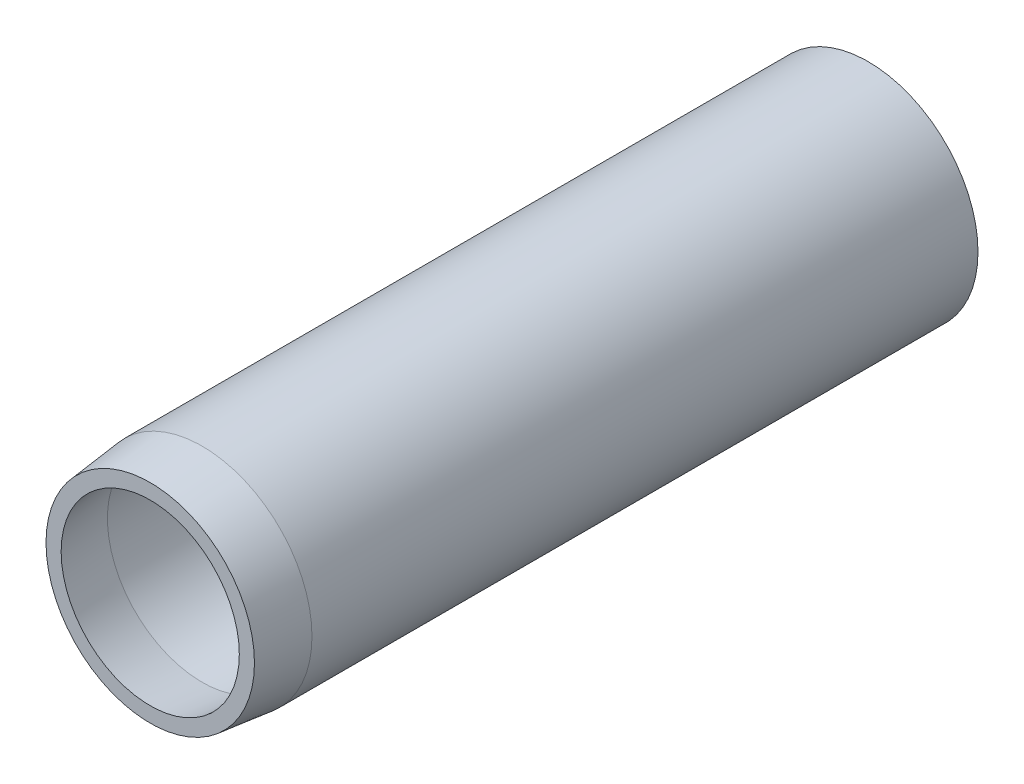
ISO-10303-21;
HEADER;
FILE_DESCRIPTION(('STEP AP214'),'2;1');
FILE_NAME('part.step','',(''),(''),'','','');
FILE_SCHEMA(('AUTOMOTIVE_DESIGN { 1 0 10303 214 1 1 1 1 }'));
ENDSEC;
DATA;
#1=APPLICATION_CONTEXT('core data for automotive mechanical design processes');
#2=APPLICATION_PROTOCOL_DEFINITION('international standard','automotive_design',2000,#1);
#3=PRODUCT_CONTEXT('',#1,'mechanical');
#4=PRODUCT('Part','Part','',(#3));
#5=PRODUCT_RELATED_PRODUCT_CATEGORY('part','',(#4));
#6=PRODUCT_DEFINITION_FORMATION('','',#4);
#7=PRODUCT_DEFINITION_CONTEXT('part definition',#1,'design');
#8=PRODUCT_DEFINITION('design','',#6,#7);
#9=PRODUCT_DEFINITION_SHAPE('','',#8);
#10=(LENGTH_UNIT() NAMED_UNIT(*) SI_UNIT(.MILLI.,.METRE.));
#11=(NAMED_UNIT(*) PLANE_ANGLE_UNIT() SI_UNIT($,.RADIAN.));
#12=(NAMED_UNIT(*) SI_UNIT($,.STERADIAN.) SOLID_ANGLE_UNIT());
#13=UNCERTAINTY_MEASURE_WITH_UNIT(LENGTH_MEASURE(1.E-05),#10,'distance_accuracy_value','');
#14=(GEOMETRIC_REPRESENTATION_CONTEXT(3) GLOBAL_UNCERTAINTY_ASSIGNED_CONTEXT((#13)) GLOBAL_UNIT_ASSIGNED_CONTEXT((#10,
#11,#12)) REPRESENTATION_CONTEXT('',''));
#15=CARTESIAN_POINT('',(0.,0.,0.));
#16=DIRECTION('',(0.,0.,1.));
#17=DIRECTION('',(1.,0.,0.));
#18=AXIS2_PLACEMENT_3D('',#15,#16,#17);
#19=CARTESIAN_POINT('',(0.,1.3081,0.));
#20=DIRECTION('',(0.,0.,-1.));
#21=DIRECTION('',(-1.,0.,0.));
#22=AXIS2_PLACEMENT_3D('',#19,#20,#21);
#23=PLANE('',#22);
#24=CARTESIAN_POINT('',(0.,0.,0.));
#25=DIRECTION('',(0.,0.,1.));
#26=DIRECTION('',(1.,0.,0.));
#27=AXIS2_PLACEMENT_3D('',#24,#25,#26);
#28=CIRCLE('',#27,1.3081);
#29=CARTESIAN_POINT('',(1.3081,0.,0.));
#30=VERTEX_POINT('',#29);
#31=EDGE_CURVE('E59',#30,#30,#28,.T.);
#32=ORIENTED_EDGE('',*,*,#31,.F.);
#33=EDGE_LOOP('',(#32));
#34=FACE_BOUND('',#33,.T.);
#35=CARTESIAN_POINT('',(0.,0.,0.));
#36=DIRECTION('',(0.,0.,1.));
#37=DIRECTION('',(1.,0.,0.));
#38=AXIS2_PLACEMENT_3D('',#35,#36,#37);
#39=CIRCLE('',#38,1.53035);
#40=CARTESIAN_POINT('',(1.53035,0.,0.));
#41=VERTEX_POINT('',#40);
#42=EDGE_CURVE('E10',#41,#41,#39,.T.);
#43=ORIENTED_EDGE('',*,*,#42,.T.);
#44=EDGE_LOOP('',(#43));
#45=FACE_BOUND('',#44,.T.);
#46=ADVANCED_FACE('F28',(#34,#45),#23,.F.);
#47=CARTESIAN_POINT('',(0.,0.,-0.761999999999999));
#48=DIRECTION('',(0.,0.,-1.));
#49=DIRECTION('',(-1.,0.,0.));
#50=AXIS2_PLACEMENT_3D('',#47,#48,#49);
#51=CONICAL_SURFACE('',#50,1.6129,0.107912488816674);
#52=ORIENTED_EDGE('',*,*,#42,.F.);
#53=EDGE_LOOP('',(#52));
#54=FACE_BOUND('',#53,.T.);
#55=CARTESIAN_POINT('',(0.,0.,-0.761999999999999));
#56=DIRECTION('',(0.,0.,1.));
#57=DIRECTION('',(1.,0.,0.));
#58=AXIS2_PLACEMENT_3D('',#55,#56,#57);
#59=CIRCLE('',#58,1.6129);
#60=CARTESIAN_POINT('',(1.6129,0.,-0.761999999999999));
#61=VERTEX_POINT('',#60);
#62=EDGE_CURVE('E34',#61,#61,#59,.T.);
#63=ORIENTED_EDGE('',*,*,#62,.T.);
#64=EDGE_LOOP('',(#63));
#65=FACE_BOUND('',#64,.T.);
#66=ADVANCED_FACE('F66',(#54,#65),#51,.T.);
#67=CARTESIAN_POINT('',(0.,0.,15.7601929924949));
#68=DIRECTION('',(0.,0.,1.));
#69=DIRECTION('',(1.,0.,0.));
#70=AXIS2_PLACEMENT_3D('',#67,#68,#69);
#71=CYLINDRICAL_SURFACE('',#70,1.6129);
#72=ORIENTED_EDGE('',*,*,#62,.F.);
#73=EDGE_LOOP('',(#72));
#74=FACE_BOUND('',#73,.T.);
#75=CARTESIAN_POINT('',(0.,0.,-10.541));
#76=DIRECTION('',(0.,0.,1.));
#77=DIRECTION('',(1.,0.,0.));
#78=AXIS2_PLACEMENT_3D('',#75,#76,#77);
#79=CIRCLE('',#78,1.6129);
#80=CARTESIAN_POINT('',(1.6129,0.,-10.541));
#81=VERTEX_POINT('',#80);
#82=EDGE_CURVE('E38',#81,#81,#79,.T.);
#83=ORIENTED_EDGE('',*,*,#82,.T.);
#84=EDGE_LOOP('',(#83));
#85=FACE_BOUND('',#84,.T.);
#86=ADVANCED_FACE('F70',(#74,#85),#71,.T.);
#87=CARTESIAN_POINT('',(0.,1.6129,-10.541));
#88=DIRECTION('',(0.,0.,1.));
#89=DIRECTION('',(1.,0.,0.));
#90=AXIS2_PLACEMENT_3D('',#87,#88,#89);
#91=PLANE('',#90);
#92=ORIENTED_EDGE('',*,*,#82,.F.);
#93=EDGE_LOOP('',(#92));
#94=FACE_BOUND('',#93,.T.);
#95=CARTESIAN_POINT('',(0.,0.,-10.541));
#96=DIRECTION('',(0.,0.,1.));
#97=DIRECTION('',(1.,0.,0.));
#98=AXIS2_PLACEMENT_3D('',#95,#96,#97);
#99=CIRCLE('',#98,1.143);
#100=CARTESIAN_POINT('',(1.143,0.,-10.541));
#101=VERTEX_POINT('',#100);
#102=EDGE_CURVE('E42',#101,#101,#99,.T.);
#103=ORIENTED_EDGE('',*,*,#102,.T.);
#104=EDGE_LOOP('',(#103));
#105=FACE_BOUND('',#104,.T.);
#106=ADVANCED_FACE('F75',(#94,#105),#91,.F.);
#107=CARTESIAN_POINT('',(0.,0.,-10.0296612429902));
#108=DIRECTION('',(0.,0.,-1.));
#109=DIRECTION('',(-1.,0.,0.));
#110=AXIS2_PLACEMENT_3D('',#107,#108,#109);
#111=CONICAL_SURFACE('',#110,0.6985,0.715584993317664);
#112=ORIENTED_EDGE('',*,*,#102,.F.);
#113=EDGE_LOOP('',(#112));
#114=FACE_BOUND('',#113,.T.);
#115=CARTESIAN_POINT('',(0.,0.,-10.0296612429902));
#116=DIRECTION('',(0.,0.,1.));
#117=DIRECTION('',(1.,0.,0.));
#118=AXIS2_PLACEMENT_3D('',#115,#116,#117);
#119=CIRCLE('',#118,0.6985);
#120=CARTESIAN_POINT('',(0.6985,0.,-10.0296612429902));
#121=VERTEX_POINT('',#120);
#122=EDGE_CURVE('E47',#121,#121,#119,.T.);
#123=ORIENTED_EDGE('',*,*,#122,.T.);
#124=EDGE_LOOP('',(#123));
#125=FACE_BOUND('',#124,.T.);
#126=ADVANCED_FACE('F81',(#114,#125),#111,.F.);
#127=CARTESIAN_POINT('',(0.,0.,15.7601929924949));
#128=DIRECTION('',(0.,0.,1.));
#129=DIRECTION('',(1.,0.,0.));
#130=AXIS2_PLACEMENT_3D('',#127,#128,#129);
#131=CYLINDRICAL_SURFACE('',#130,0.6985);
#132=ORIENTED_EDGE('',*,*,#122,.F.);
#133=EDGE_LOOP('',(#132));
#134=FACE_BOUND('',#133,.T.);
#135=CARTESIAN_POINT('',(0.,0.,-9.525));
#136=DIRECTION('',(0.,0.,1.));
#137=DIRECTION('',(1.,0.,0.));
#138=AXIS2_PLACEMENT_3D('',#135,#136,#137);
#139=CIRCLE('',#138,0.6985);
#140=CARTESIAN_POINT('',(0.6985,0.,-9.525));
#141=VERTEX_POINT('',#140);
#142=EDGE_CURVE('E50',#141,#141,#139,.T.);
#143=ORIENTED_EDGE('',*,*,#142,.T.);
#144=EDGE_LOOP('',(#143));
#145=FACE_BOUND('',#144,.T.);
#146=ADVANCED_FACE('F85',(#134,#145),#131,.F.);
#147=CARTESIAN_POINT('',(0.,0.6985,-9.525));
#148=DIRECTION('',(0.,0.,-1.));
#149=DIRECTION('',(-1.,0.,0.));
#150=AXIS2_PLACEMENT_3D('',#147,#148,#149);
#151=PLANE('',#150);
#152=ORIENTED_EDGE('',*,*,#142,.F.);
#153=EDGE_LOOP('',(#152));
#154=FACE_BOUND('',#153,.T.);
#155=CARTESIAN_POINT('',(0.,0.,-9.525));
#156=DIRECTION('',(0.,0.,1.));
#157=DIRECTION('',(1.,0.,0.));
#158=AXIS2_PLACEMENT_3D('',#155,#156,#157);
#159=CIRCLE('',#158,1.39065);
#160=CARTESIAN_POINT('',(1.39065,0.,-9.525));
#161=VERTEX_POINT('',#160);
#162=EDGE_CURVE('E53',#161,#161,#159,.T.);
#163=ORIENTED_EDGE('',*,*,#162,.T.);
#164=EDGE_LOOP('',(#163));
#165=FACE_BOUND('',#164,.T.);
#166=ADVANCED_FACE('F89',(#154,#165),#151,.F.);
#167=CARTESIAN_POINT('',(0.,0.,15.7601929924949));
#168=DIRECTION('',(0.,0.,1.));
#169=DIRECTION('',(1.,0.,0.));
#170=AXIS2_PLACEMENT_3D('',#167,#168,#169);
#171=CYLINDRICAL_SURFACE('',#170,1.39065);
#172=ORIENTED_EDGE('',*,*,#162,.F.);
#173=EDGE_LOOP('',(#172));
#174=FACE_BOUND('',#173,.T.);
#175=CARTESIAN_POINT('',(0.,0.,-0.761999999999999));
#176=DIRECTION('',(0.,0.,1.));
#177=DIRECTION('',(1.,0.,0.));
#178=AXIS2_PLACEMENT_3D('',#175,#176,#177);
#179=CIRCLE('',#178,1.39065);
#180=CARTESIAN_POINT('',(1.39065,0.,-0.761999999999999));
#181=VERTEX_POINT('',#180);
#182=EDGE_CURVE('E56',#181,#181,#179,.T.);
#183=ORIENTED_EDGE('',*,*,#182,.T.);
#184=EDGE_LOOP('',(#183));
#185=FACE_BOUND('',#184,.T.);
#186=ADVANCED_FACE('F93',(#174,#185),#171,.F.);
#187=CARTESIAN_POINT('',(0.,0.,0.));
#188=DIRECTION('',(0.,0.,-1.));
#189=DIRECTION('',(-1.,0.,0.));
#190=AXIS2_PLACEMENT_3D('',#187,#188,#189);
#191=CONICAL_SURFACE('',#190,1.3081,0.107912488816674);
#192=ORIENTED_EDGE('',*,*,#182,.F.);
#193=EDGE_LOOP('',(#192));
#194=FACE_BOUND('',#193,.T.);
#195=ORIENTED_EDGE('',*,*,#31,.T.);
#196=EDGE_LOOP('',(#195));
#197=FACE_BOUND('',#196,.T.);
#198=ADVANCED_FACE('F63',(#194,#197),#191,.F.);
#199=CLOSED_SHELL('',(#46,#66,#86,#106,#126,#146,#166,#186,#198));
#200=MANIFOLD_SOLID_BREP('B2',#199);
#201=ADVANCED_BREP_SHAPE_REPRESENTATION('',(#18,#200),#14);
#202=SHAPE_DEFINITION_REPRESENTATION(#9,#201);
ENDSEC;
END-ISO-10303-21;
